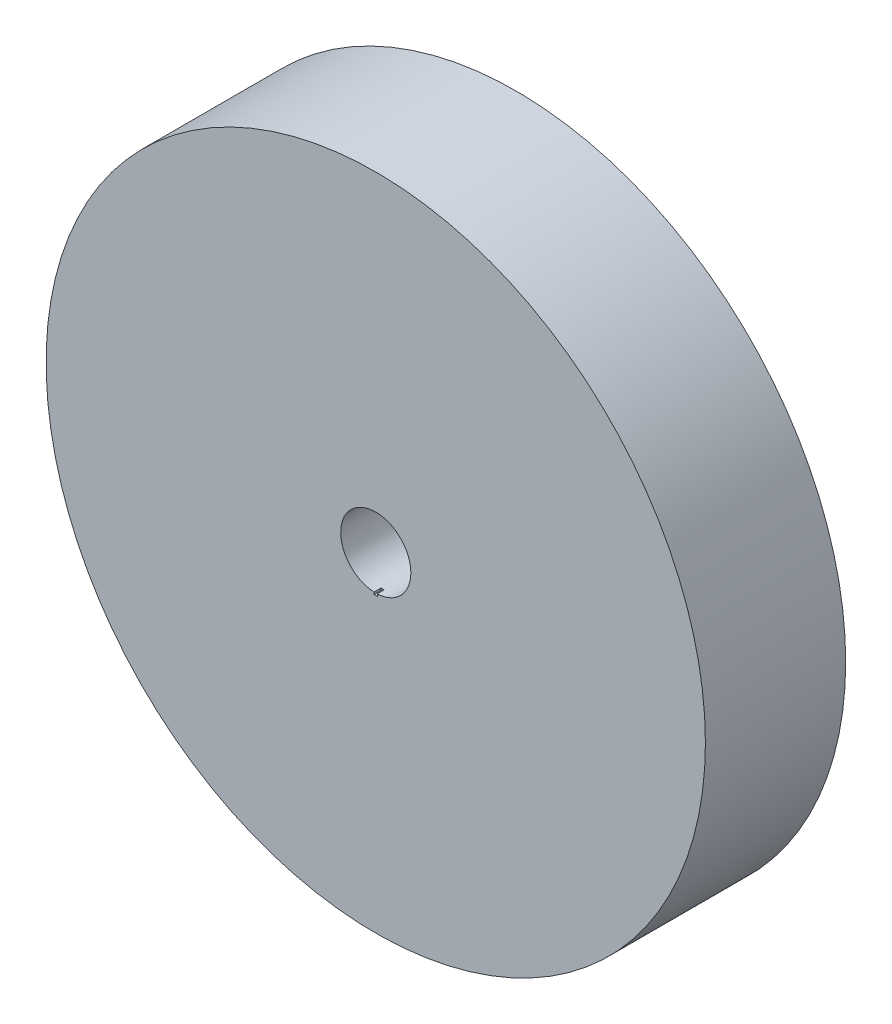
from build123d import *

# Parameters (mm, degrees)
ESQUISSE1_R             = 4.7
ESQUISSE1_R_2           = 0.5
EXTRUSION1_DEPTH        = 2
ESQUISSE2_W             = 0.045814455
ESQUISSE2_H             = 0.21761866
ENL_V_MAT_EXTRU_5_DEPTH = 0.1


with BuildPart() as part:
    # Esquisse1 → Extrusion1 (new body)
    with BuildSketch(Plane.XY):
        Circle(ESQUISSE1_R)
        Circle(ESQUISSE1_R_2, mode=Mode.SUBTRACT)
    extrude(amount=-EXTRUSION1_DEPTH)

    # Esquisse2 → Enl_v. mat.-Extru.5 (cut)
    with BuildSketch(Plane.XY):
        with Locations((-0.001522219, -0.421161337)):
            Rectangle(ESQUISSE2_W, ESQUISSE2_H)
    extrude(amount=-ENL_V_MAT_EXTRU_5_DEPTH, mode=Mode.SUBTRACT)


solid = part.part
